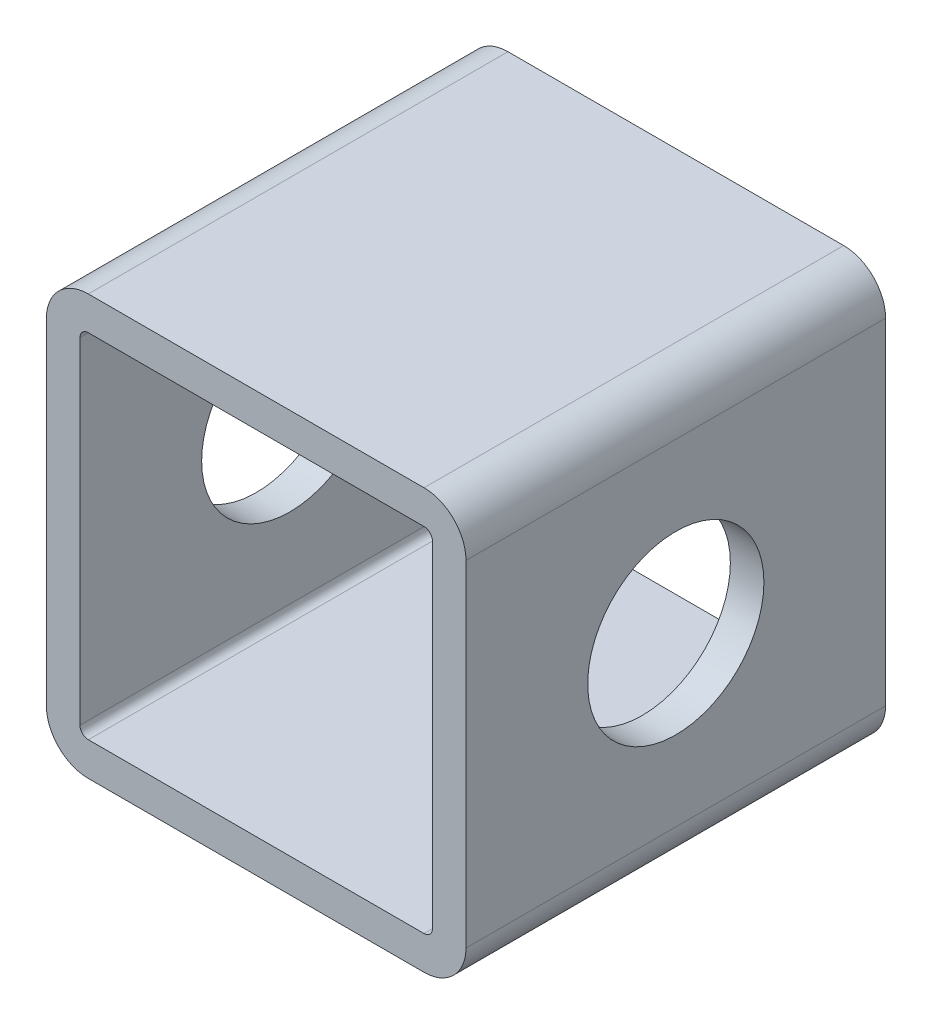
from build123d import *

# Parameters (mm, degrees)
BASE_EXTRUSION_DEPTH    = 50
ESQUISSE2_R             = 10.5
ENL_V_MAT_EXTRU_1_DEPTH = 87.602540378


with BuildPart() as part:
    # Esquisse1 → Base-Extrusion (new body)
    with BuildSketch(Plane.XY):
        with BuildLine():
            Line((5, 0), (45, 0))
            ThreePointArc((45, 0), (48.535533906, -1.464466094), (50, -5))
            Line((50, -5), (50, -45))
            ThreePointArc((50, -45), (48.535533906, -48.535533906), (45, -50))
            Line((45, -50), (5, -50))
            ThreePointArc((5, -50), (1.464466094, -48.535533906), (0, -45))
            Line((0, -45), (0, -5))
            ThreePointArc((0, -5), (1.464466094, -1.464466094), (5, 0))
        make_face()
        with BuildLine():
            Line((4, -5), (4, -45))
            ThreePointArc((4, -45), (4.292893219, -45.707106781), (5, -46))
            Line((5, -46), (45, -46))
            ThreePointArc((45, -46), (45.707106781, -45.707106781), (46, -45))
            Line((46, -45), (46, -5))
            ThreePointArc((46, -5), (45.707106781, -4.292893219), (45, -4))
            Line((45, -4), (5, -4))
            ThreePointArc((5, -4), (4.292893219, -4.292893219), (4, -5))
        make_face(mode=Mode.SUBTRACT)
    extrude(amount=BASE_EXTRUSION_DEPTH)

    # Esquisse2 → Enl_v. mat.-Extru.1 (cut, through all)
    with BuildSketch(Plane(origin=(50, 0, 0), x_dir=(0, 0, -1), z_dir=(1, 0, 0))):
        with Locations((-25, -25)):
            Circle(ESQUISSE2_R)
    extrude(amount=-ENL_V_MAT_EXTRU_1_DEPTH, mode=Mode.SUBTRACT)


solid = part.part
